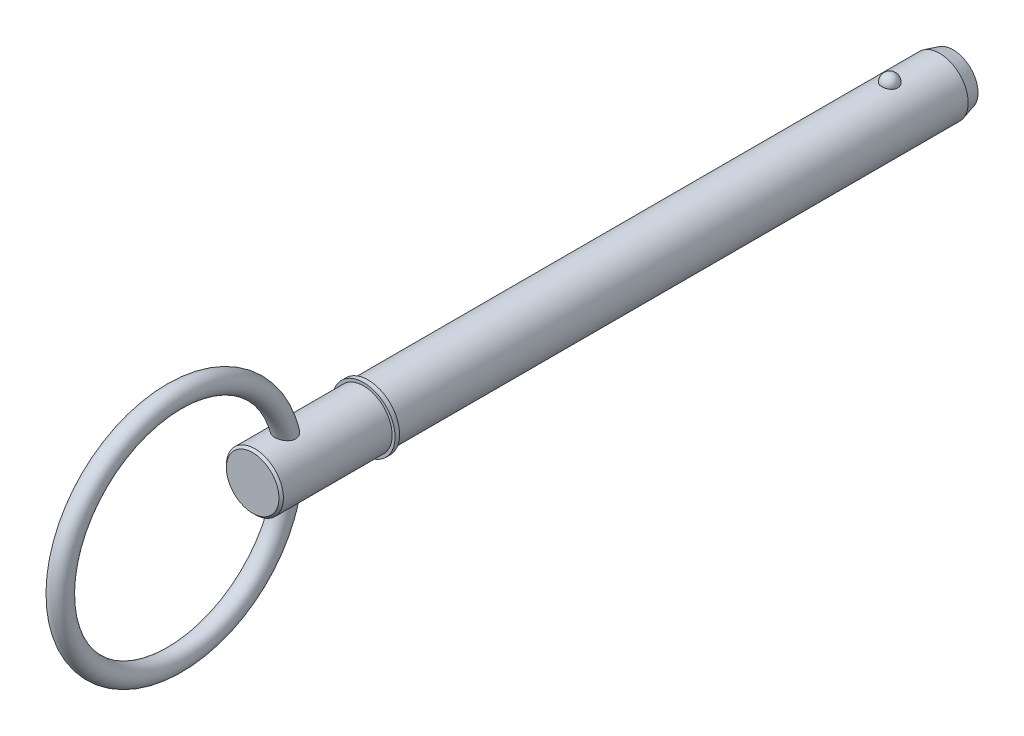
ISO-10303-21;
HEADER;
FILE_DESCRIPTION(('STEP AP214'),'2;1');
FILE_NAME('part.step','',(''),(''),'','','');
FILE_SCHEMA(('AUTOMOTIVE_DESIGN { 1 0 10303 214 1 1 1 1 }'));
ENDSEC;
DATA;
#1=APPLICATION_CONTEXT('core data for automotive mechanical design processes');
#2=APPLICATION_PROTOCOL_DEFINITION('international standard','automotive_design',2000,#1);
#3=PRODUCT_CONTEXT('',#1,'mechanical');
#4=PRODUCT('Part','Part','',(#3));
#5=PRODUCT_RELATED_PRODUCT_CATEGORY('part','',(#4));
#6=PRODUCT_DEFINITION_FORMATION('','',#4);
#7=PRODUCT_DEFINITION_CONTEXT('part definition',#1,'design');
#8=PRODUCT_DEFINITION('design','',#6,#7);
#9=PRODUCT_DEFINITION_SHAPE('','',#8);
#10=(LENGTH_UNIT() NAMED_UNIT(*) SI_UNIT(.MILLI.,.METRE.));
#11=(NAMED_UNIT(*) PLANE_ANGLE_UNIT() SI_UNIT($,.RADIAN.));
#12=(NAMED_UNIT(*) SI_UNIT($,.STERADIAN.) SOLID_ANGLE_UNIT());
#13=UNCERTAINTY_MEASURE_WITH_UNIT(LENGTH_MEASURE(1.E-05),#10,'distance_accuracy_value','');
#14=(GEOMETRIC_REPRESENTATION_CONTEXT(3) GLOBAL_UNCERTAINTY_ASSIGNED_CONTEXT((#13)) GLOBAL_UNIT_ASSIGNED_CONTEXT((#10,
#11,#12)) REPRESENTATION_CONTEXT('',''));
#15=CARTESIAN_POINT('',(0.,0.,0.));
#16=DIRECTION('',(0.,0.,1.));
#17=DIRECTION('',(1.,0.,0.));
#18=AXIS2_PLACEMENT_3D('',#15,#16,#17);
#19=CARTESIAN_POINT('',(0.,0.,114.3));
#20=DIRECTION('',(0.,0.,-1.));
#21=DIRECTION('',(-1.,0.,0.));
#22=AXIS2_PLACEMENT_3D('',#19,#20,#21);
#23=CYLINDRICAL_SURFACE('',#22,6.35);
#24=CARTESIAN_POINT('',(1.76243001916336,6.10051968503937,-1.78));
#25=CARTESIAN_POINT('',(1.76242835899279,6.10052111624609,-1.68050311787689));
#26=CARTESIAN_POINT('',(1.75431593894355,6.1028816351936,-1.58098521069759));
#27=CARTESIAN_POINT('',(1.72206027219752,6.11206037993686,-1.38476972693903));
#28=CARTESIAN_POINT('',(1.69791106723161,6.11888026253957,-1.28807321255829));
#29=CARTESIAN_POINT('',(1.63419596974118,6.13620287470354,-1.10029899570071));
#30=CARTESIAN_POINT('',(1.59463684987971,6.14670398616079,-1.00921884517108));
#31=CARTESIAN_POINT('',(1.50108569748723,6.17021534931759,-0.83516140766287));
#32=CARTESIAN_POINT('',(1.44709398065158,6.18322554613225,-0.752183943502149));
#33=CARTESIAN_POINT('',(1.3257243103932,6.21038081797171,-0.596209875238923));
#34=CARTESIAN_POINT('',(1.2582815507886,6.22453118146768,-0.523264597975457));
#35=CARTESIAN_POINT('',(1.11191624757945,6.25233390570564,-0.389855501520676));
#36=CARTESIAN_POINT('',(1.03299369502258,6.26598626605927,-0.329391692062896));
#37=CARTESIAN_POINT('',(0.866022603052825,6.29123226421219,-0.222793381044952));
#38=CARTESIAN_POINT('',(0.778000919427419,6.30283170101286,-0.176618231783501));
#39=CARTESIAN_POINT('',(0.59510847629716,6.32272058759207,-0.0996905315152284));
#40=CARTESIAN_POINT('',(0.500238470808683,6.33101040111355,-0.0689362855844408));
#41=CARTESIAN_POINT('',(0.308164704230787,6.34323464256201,-0.024159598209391));
#42=CARTESIAN_POINT('',(0.211033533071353,6.34724467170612,-0.00984637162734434));
#43=CARTESIAN_POINT('',(0.0156629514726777,6.3507318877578,0.00262058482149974));
#44=CARTESIAN_POINT('',(-0.0825763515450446,6.35020951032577,0.000775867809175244));
#45=CARTESIAN_POINT('',(-0.275890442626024,6.34473055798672,-0.0188727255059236));
#46=CARTESIAN_POINT('',(-0.370990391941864,6.3398374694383,-0.0364481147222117));
#47=CARTESIAN_POINT('',(-0.556805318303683,6.32622723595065,-0.0867447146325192));
#48=CARTESIAN_POINT('',(-0.647520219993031,6.31751002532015,-0.119466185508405));
#49=CARTESIAN_POINT('',(-0.822606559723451,6.29711353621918,-0.199386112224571));
#50=CARTESIAN_POINT('',(-0.906938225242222,6.28541739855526,-0.246667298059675));
#51=CARTESIAN_POINT('',(-1.06646479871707,6.26032612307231,-0.354365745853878));
#52=CARTESIAN_POINT('',(-1.14165877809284,6.24693081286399,-0.41478434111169));
#53=CARTESIAN_POINT('',(-1.2823514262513,6.21959142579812,-0.548435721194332));
#54=CARTESIAN_POINT('',(-1.34763761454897,6.2056417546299,-0.621891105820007));
#55=CARTESIAN_POINT('',(-1.4651153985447,6.17896241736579,-0.778815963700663));
#56=CARTESIAN_POINT('',(-1.51730606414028,6.16623283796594,-0.862286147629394));
#57=CARTESIAN_POINT('',(-1.60782211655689,6.14325839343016,-1.03799158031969));
#58=CARTESIAN_POINT('',(-1.64598111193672,6.13304379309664,-1.13031660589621));
#59=CARTESIAN_POINT('',(-1.70661885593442,6.11644899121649,-1.32030667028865));
#60=CARTESIAN_POINT('',(-1.72909805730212,6.11006867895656,-1.41797155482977));
#61=CARTESIAN_POINT('',(-1.75775019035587,6.1018881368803,-1.61543246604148));
#62=CARTESIAN_POINT('',(-1.76399136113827,6.10006874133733,-1.71521779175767));
#63=CARTESIAN_POINT('',(-1.76020715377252,6.10116172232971,-1.91445126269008));
#64=CARTESIAN_POINT('',(-1.75018221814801,6.10407397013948,-2.01389941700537));
#65=CARTESIAN_POINT('',(-1.71421005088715,6.11427232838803,-2.20912106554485));
#66=CARTESIAN_POINT('',(-1.68834262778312,6.12153651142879,-2.30491043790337));
#67=CARTESIAN_POINT('',(-1.62139543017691,6.1396067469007,-2.49066180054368));
#68=CARTESIAN_POINT('',(-1.5803150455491,6.15041294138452,-2.58062355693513));
#69=CARTESIAN_POINT('',(-1.48369112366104,6.17443456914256,-2.75271428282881));
#70=CARTESIAN_POINT('',(-1.42806998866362,6.18766281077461,-2.83479789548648));
#71=CARTESIAN_POINT('',(-1.30386620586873,6.21501934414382,-2.98832532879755));
#72=CARTESIAN_POINT('',(-1.23528306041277,6.22914767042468,-3.05976874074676));
#73=CARTESIAN_POINT('',(-1.08663999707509,6.25679135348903,-3.19029656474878));
#74=CARTESIAN_POINT('',(-1.00653826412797,6.27030422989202,-3.24933392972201));
#75=CARTESIAN_POINT('',(-0.837212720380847,6.29514770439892,-3.35304657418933));
#76=CARTESIAN_POINT('',(-0.747989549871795,6.30647845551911,-3.39772286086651));
#77=CARTESIAN_POINT('',(-0.564098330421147,6.32556124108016,-3.47096393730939));
#78=CARTESIAN_POINT('',(-0.469512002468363,6.33335611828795,-3.49972259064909));
#79=CARTESIAN_POINT('',(-0.27663389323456,6.34470628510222,-3.54113722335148));
#80=CARTESIAN_POINT('',(-0.17834256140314,6.34826208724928,-3.55379514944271));
#81=CARTESIAN_POINT('',(0.0171660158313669,6.35071525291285,-3.56255473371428));
#82=CARTESIAN_POINT('',(0.114368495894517,6.34969931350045,-3.55896450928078));
#83=CARTESIAN_POINT('',(0.306746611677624,6.34331695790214,-3.53603383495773));
#84=CARTESIAN_POINT('',(0.401922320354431,6.33795069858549,-3.51669395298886));
#85=CARTESIAN_POINT('',(0.587203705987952,6.32347219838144,-3.4629173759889));
#86=CARTESIAN_POINT('',(0.677327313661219,6.31437430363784,-3.42853846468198));
#87=CARTESIAN_POINT('',(0.850462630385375,6.29339543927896,-3.34564128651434));
#88=CARTESIAN_POINT('',(0.933473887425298,6.2815142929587,-3.29712212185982));
#89=CARTESIAN_POINT('',(1.09144542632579,6.25601750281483,-3.18638742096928));
#90=CARTESIAN_POINT('',(1.16626195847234,6.24237795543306,-3.12397237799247));
#91=CARTESIAN_POINT('',(1.304448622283,6.21497285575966,-2.98755865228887));
#92=CARTESIAN_POINT('',(1.36781676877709,6.20120728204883,-2.91355796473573));
#93=CARTESIAN_POINT('',(1.48252779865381,6.17479923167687,-2.75456133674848));
#94=CARTESIAN_POINT('',(1.53364167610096,6.16218052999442,-2.66939613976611));
#95=CARTESIAN_POINT('',(1.62109397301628,6.13975602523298,-2.49147502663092));
#96=CARTESIAN_POINT('',(1.657437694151,6.12994921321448,-2.39872184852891));
#97=CARTESIAN_POINT('',(1.71127844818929,6.11512175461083,-2.21887622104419));
#98=CARTESIAN_POINT('',(1.73042646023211,6.10968903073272,-2.13230770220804));
#99=CARTESIAN_POINT('',(1.75600284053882,6.10238739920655,-1.95716498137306));
#100=CARTESIAN_POINT('',(1.76243149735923,6.10051841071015,-1.86859082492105));
#101=CARTESIAN_POINT('',(1.76243001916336,6.10051968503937,-1.78));
#102=B_SPLINE_CURVE_WITH_KNOTS('',3,(#24,#25,#26,#27,#28,#29,#30,#31,#32,#33,#34,#35,#36,#37,
#38,#39,#40,#41,#42,#43,#44,#45,#46,#47,#48,#49,#50,#51,#52,#53,#54,#55,#56,#57,#58,#59,#60,#61,
#62,#63,#64,#65,#66,#67,#68,#69,#70,#71,#72,#73,#74,#75,#76,#77,#78,#79,#80,#81,#82,#83,#84,#85,
#86,#87,#88,#89,#90,#91,#92,#93,#94,#95,#96,#97,#98,#99,#100,#101),.UNSPECIFIED.,.T.,.F.,(4,2,2,
2,2,2,2,2,2,2,2,2,2,2,2,2,2,2,2,2,2,2,2,2,2,2,2,2,2,2,2,2,2,2,2,2,2,2,4),(0.,0.298172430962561,
0.596455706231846,0.894608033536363,1.19275383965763,1.49237238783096,1.79199116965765,
2.09074960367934,2.38947519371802,2.68283180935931,2.97616022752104,3.26529599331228,
3.5544367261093,3.84525169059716,4.13609618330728,4.43249276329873,4.72891038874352,
5.02873757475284,5.32855610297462,5.62711261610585,5.92566100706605,6.22271765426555,
6.519786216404,6.81847366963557,7.11717259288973,7.41698459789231,7.71677557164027,
8.01283014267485,8.30884891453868,8.59927798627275,8.88969658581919,9.17900899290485,
9.46833977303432,9.76212836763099,10.0559678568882,10.3549321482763,10.6537890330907,
10.9192841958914,11.1847733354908),.UNSPECIFIED.);
#103=CARTESIAN_POINT('',(1.76243001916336,6.10051968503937,-1.78));
#104=VERTEX_POINT('',#103);
#105=EDGE_CURVE('E101',#104,#104,#102,.T.);
#106=ORIENTED_EDGE('',*,*,#105,.T.);
#107=EDGE_LOOP('',(#106));
#108=FACE_BOUND('',#107,.T.);
#109=CARTESIAN_POINT('',(0.,0.,-12.88));
#110=DIRECTION('',(0.,0.,-1.));
#111=DIRECTION('',(-1.,0.,0.));
#112=AXIS2_PLACEMENT_3D('',#109,#110,#111);
#113=CIRCLE('',#112,6.35);
#114=CARTESIAN_POINT('',(-6.35,0.,-12.88));
#115=VERTEX_POINT('',#114);
#116=EDGE_CURVE('E109',#115,#115,#113,.F.);
#117=ORIENTED_EDGE('',*,*,#116,.T.);
#118=EDGE_LOOP('',(#117));
#119=FACE_BOUND('',#118,.T.);
#120=CARTESIAN_POINT('',(0.,0.,114.3));
#121=DIRECTION('',(0.,0.,1.));
#122=DIRECTION('',(1.,0.,0.));
#123=AXIS2_PLACEMENT_3D('',#120,#121,#122);
#124=CIRCLE('',#123,6.35);
#125=CARTESIAN_POINT('',(6.35,0.,114.3));
#126=VERTEX_POINT('',#125);
#127=EDGE_CURVE('E107',#126,#126,#124,.T.);
#128=ORIENTED_EDGE('',*,*,#127,.F.);
#129=EDGE_LOOP('',(#128));
#130=FACE_BOUND('',#129,.T.);
#131=ADVANCED_FACE('F39',(#108,#119,#130),#23,.T.);
#132=CARTESIAN_POINT('',(0.,0.,-15.88));
#133=DIRECTION('',(0.,0.,-1.));
#134=DIRECTION('',(-1.,0.,0.));
#135=AXIS2_PLACEMENT_3D('',#132,#133,#134);
#136=PLANE('',#135);
#137=CARTESIAN_POINT('',(0.,0.,-15.88));
#138=DIRECTION('',(0.,0.,-1.));
#139=DIRECTION('',(-1.,0.,0.));
#140=AXIS2_PLACEMENT_3D('',#137,#138,#139);
#141=CIRCLE('',#140,5.54615242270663);
#142=CARTESIAN_POINT('',(-5.54615242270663,0.,-15.88));
#143=VERTEX_POINT('',#142);
#144=EDGE_CURVE('E143',#143,#143,#141,.T.);
#145=ORIENTED_EDGE('',*,*,#144,.T.);
#146=EDGE_LOOP('',(#145));
#147=FACE_BOUND('',#146,.T.);
#148=ADVANCED_FACE('F87',(#147),#136,.T.);
#149=CARTESIAN_POINT('',(0.,0.,-15.88));
#150=DIRECTION('',(0.,0.,1.));
#151=DIRECTION('',(1.,0.,0.));
#152=AXIS2_PLACEMENT_3D('',#149,#150,#151);
#153=CONICAL_SURFACE('',#152,5.54615242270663,0.261799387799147);
#154=ORIENTED_EDGE('',*,*,#116,.F.);
#155=EDGE_LOOP('',(#154));
#156=FACE_BOUND('',#155,.T.);
#157=ORIENTED_EDGE('',*,*,#144,.F.);
#158=EDGE_LOOP('',(#157));
#159=FACE_BOUND('',#158,.T.);
#160=ADVANCED_FACE('F93',(#156,#159),#153,.T.);
#161=CARTESIAN_POINT('',(0.,6.35,-1.78));
#162=DIRECTION('',(0.,1.,0.));
#163=DIRECTION('',(0.,0.,1.));
#164=AXIS2_PLACEMENT_3D('',#161,#162,#163);
#165=SPHERICAL_SURFACE('',#164,1.78);
#166=ORIENTED_EDGE('',*,*,#105,.F.);
#167=EDGE_LOOP('',(#166));
#168=FACE_BOUND('',#167,.T.);
#169=ADVANCED_FACE('F112',(#168),#165,.T.);
#170=CARTESIAN_POINT('',(0.,0.,114.3));
#171=DIRECTION('',(0.,0.,-1.));
#172=DIRECTION('',(-1.,0.,0.));
#173=AXIS2_PLACEMENT_3D('',#170,#171,#172);
#174=PLANE('',#173);
#175=ORIENTED_EDGE('',*,*,#127,.T.);
#176=EDGE_LOOP('',(#175));
#177=FACE_BOUND('',#176,.T.);
#178=CARTESIAN_POINT('',(0.,0.,114.3));
#179=DIRECTION('',(0.,0.,-1.));
#180=DIRECTION('',(-1.,0.,0.));
#181=AXIS2_PLACEMENT_3D('',#178,#179,#180);
#182=CIRCLE('',#181,7.);
#183=CARTESIAN_POINT('',(-7.,0.,114.3));
#184=VERTEX_POINT('',#183);
#185=EDGE_CURVE('E108',#184,#184,#182,.T.);
#186=ORIENTED_EDGE('',*,*,#185,.T.);
#187=EDGE_LOOP('',(#186));
#188=FACE_BOUND('',#187,.T.);
#189=ADVANCED_FACE('F116',(#177,#188),#174,.T.);
#190=CARTESIAN_POINT('',(0.,0.,33.7287874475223));
#191=DIRECTION('',(0.,0.,-1.));
#192=DIRECTION('',(-1.,0.,0.));
#193=AXIS2_PLACEMENT_3D('',#190,#191,#192);
#194=CYLINDRICAL_SURFACE('',#193,7.);
#195=CARTESIAN_POINT('',(0.,0.,115.3));
#196=DIRECTION('',(0.,0.,-1.));
#197=DIRECTION('',(-1.,0.,0.));
#198=AXIS2_PLACEMENT_3D('',#195,#196,#197);
#199=CIRCLE('',#198,7.);
#200=CARTESIAN_POINT('',(-7.,0.,115.3));
#201=VERTEX_POINT('',#200);
#202=EDGE_CURVE('E133',#201,#201,#199,.T.);
#203=ORIENTED_EDGE('',*,*,#202,.T.);
#204=EDGE_LOOP('',(#203));
#205=FACE_BOUND('',#204,.T.);
#206=ORIENTED_EDGE('',*,*,#185,.F.);
#207=EDGE_LOOP('',(#206));
#208=FACE_BOUND('',#207,.T.);
#209=ADVANCED_FACE('F120',(#205,#208),#194,.T.);
#210=CARTESIAN_POINT('',(0.,7.,115.3));
#211=DIRECTION('',(0.,0.,1.));
#212=DIRECTION('',(1.,0.,0.));
#213=AXIS2_PLACEMENT_3D('',#210,#211,#212);
#214=PLANE('',#213);
#215=CARTESIAN_POINT('',(0.,0.,115.3));
#216=DIRECTION('',(0.,0.,1.));
#217=DIRECTION('',(1.,0.,0.));
#218=AXIS2_PLACEMENT_3D('',#215,#216,#217);
#219=CIRCLE('',#218,6.35);
#220=CARTESIAN_POINT('',(6.35,0.,115.3));
#221=VERTEX_POINT('',#220);
#222=EDGE_CURVE('E111',#221,#221,#219,.T.);
#223=ORIENTED_EDGE('',*,*,#222,.F.);
#224=EDGE_LOOP('',(#223));
#225=FACE_BOUND('',#224,.T.);
#226=ORIENTED_EDGE('',*,*,#202,.F.);
#227=EDGE_LOOP('',(#226));
#228=FACE_BOUND('',#227,.T.);
#229=ADVANCED_FACE('F84',(#225,#228),#214,.T.);
#230=CARTESIAN_POINT('',(0.,0.,140.));
#231=DIRECTION('',(0.,0.,-1.));
#232=DIRECTION('',(-1.,0.,0.));
#233=AXIS2_PLACEMENT_3D('',#230,#231,#232);
#234=CYLINDRICAL_SURFACE('',#233,6.35);
#235=CARTESIAN_POINT('',(-1.08120660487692,-6.25727514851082,130.75158117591));
#236=CARTESIAN_POINT('',(-0.970724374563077,-6.27636409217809,130.693879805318));
#237=CARTESIAN_POINT('',(-0.855136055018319,-6.29329984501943,130.645219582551));
#238=CARTESIAN_POINT('',(-0.616958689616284,-6.32109419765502,130.56705594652));
#239=CARTESIAN_POINT('',(-0.494369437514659,-6.3319526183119,130.53755309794));
#240=CARTESIAN_POINT('',(-0.245606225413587,-6.34647141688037,130.498367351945));
#241=CARTESIAN_POINT('',(-0.119431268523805,-6.35012977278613,130.488690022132));
#242=CARTESIAN_POINT('',(0.132849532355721,-6.34986313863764,130.489400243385));
#243=CARTESIAN_POINT('',(0.258955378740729,-6.34593843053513,130.499787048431));
#244=CARTESIAN_POINT('',(0.506912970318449,-6.33094785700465,130.540285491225));
#245=CARTESIAN_POINT('',(0.628781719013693,-6.31991516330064,130.570305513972));
#246=CARTESIAN_POINT('',(0.865486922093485,-6.29187143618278,130.649308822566));
#247=CARTESIAN_POINT('',(0.980322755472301,-6.27485987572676,130.698293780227));
#248=CARTESIAN_POINT('',(1.20050616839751,-6.23649440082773,130.814540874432));
#249=CARTESIAN_POINT('',(1.30578867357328,-6.2151135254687,130.881917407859));
#250=CARTESIAN_POINT('',(1.50311440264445,-6.17036440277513,131.033359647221));
#251=CARTESIAN_POINT('',(1.5951571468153,-6.14699608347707,131.117425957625));
#252=CARTESIAN_POINT('',(1.76326863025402,-6.10090072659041,131.300247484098));
#253=CARTESIAN_POINT('',(1.83935482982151,-6.07817301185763,131.398986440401));
#254=CARTESIAN_POINT('',(1.97338559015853,-6.03599268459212,131.608703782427));
#255=CARTESIAN_POINT('',(2.03133638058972,-6.01653894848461,131.719677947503));
#256=CARTESIAN_POINT('',(2.1259120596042,-5.98376466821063,131.947018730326));
#257=CARTESIAN_POINT('',(2.16315310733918,-5.97026970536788,132.063104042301));
#258=CARTESIAN_POINT('',(2.21830650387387,-5.94999923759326,132.300318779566));
#259=CARTESIAN_POINT('',(2.2362211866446,-5.94322292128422,132.421447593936));
#260=CARTESIAN_POINT('',(2.25273772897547,-5.93698111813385,132.663281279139));
#261=CARTESIAN_POINT('',(2.25163224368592,-5.93740484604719,132.783964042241));
#262=CARTESIAN_POINT('',(2.23167546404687,-5.94493297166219,133.023620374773));
#263=CARTESIAN_POINT('',(2.21281883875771,-5.9520393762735,133.142593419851));
#264=CARTESIAN_POINT('',(2.15679576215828,-5.97257680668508,133.383836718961));
#265=CARTESIAN_POINT('',(2.1185113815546,-5.98639144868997,133.50581287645));
#266=CARTESIAN_POINT('',(2.024702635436,-6.01876484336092,133.742284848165));
#267=CARTESIAN_POINT('',(1.96916879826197,-6.03732620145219,133.856776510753));
#268=CARTESIAN_POINT('',(1.83526629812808,-6.07945247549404,134.087995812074));
#269=CARTESIAN_POINT('',(1.75507038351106,-6.10334207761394,134.203611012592));
#270=CARTESIAN_POINT('',(1.5765788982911,-6.15186551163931,134.419894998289));
#271=CARTESIAN_POINT('',(1.47827192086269,-6.17649980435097,134.520554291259));
#272=CARTESIAN_POINT('',(1.26306696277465,-6.22410762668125,134.705023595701));
#273=CARTESIAN_POINT('',(1.14585214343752,-6.2470408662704,134.788478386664));
#274=CARTESIAN_POINT('',(0.896825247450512,-6.28760987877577,134.931400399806));
#275=CARTESIAN_POINT('',(0.765036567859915,-6.30525397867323,134.990905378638));
#276=CARTESIAN_POINT('',(0.509454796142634,-6.330648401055,135.075263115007));
#277=CARTESIAN_POINT('',(0.386964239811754,-6.33940909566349,135.103695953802));
#278=CARTESIAN_POINT('',(0.200813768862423,-6.3471308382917,135.128680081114));
#279=CARTESIAN_POINT('',(0.138353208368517,-6.34880140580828,135.134063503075));
#280=CARTESIAN_POINT('',(0.0131841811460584,-6.35029448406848,135.13887386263));
#281=CARTESIAN_POINT('',(-0.0495242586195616,-6.35011719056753,135.138301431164));
#282=CARTESIAN_POINT('',(-0.219860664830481,-6.34710452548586,135.128597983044));
#283=CARTESIAN_POINT('',(-0.327176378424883,-6.34243953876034,135.113576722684));
#284=CARTESIAN_POINT('',(-0.537619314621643,-6.32808248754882,135.066673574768));
#285=CARTESIAN_POINT('',(-0.640746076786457,-6.31838987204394,135.034789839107));
#286=CARTESIAN_POINT('',(-0.841795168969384,-6.29478075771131,134.955337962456));
#287=CARTESIAN_POINT('',(-0.939631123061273,-6.28081033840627,134.90756888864));
#288=CARTESIAN_POINT('',(-1.12690564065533,-6.2499288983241,134.798513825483));
#289=CARTESIAN_POINT('',(-1.21634109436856,-6.2330167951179,134.737222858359));
#290=CARTESIAN_POINT('',(-1.39713031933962,-6.19517308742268,134.594039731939));
#291=CARTESIAN_POINT('',(-1.48711596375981,-6.17400700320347,134.510483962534));
#292=CARTESIAN_POINT('',(-1.65373642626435,-6.13148145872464,134.330996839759));
#293=CARTESIAN_POINT('',(-1.73036130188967,-6.11012186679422,134.23505636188));
#294=CARTESIAN_POINT('',(-1.87908981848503,-6.0661652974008,134.018620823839));
#295=CARTESIAN_POINT('',(-1.94902044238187,-6.04382072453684,133.896572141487));
#296=CARTESIAN_POINT('',(-2.06849605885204,-6.00398244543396,133.642070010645));
#297=CARTESIAN_POINT('',(-2.11803457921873,-5.98649027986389,133.509613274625));
#298=CARTESIAN_POINT('',(-2.19551930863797,-5.95851933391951,133.234593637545));
#299=CARTESIAN_POINT('',(-2.22297667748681,-5.94819998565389,133.091874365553));
#300=CARTESIAN_POINT('',(-2.25222139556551,-5.93719450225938,132.803480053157));
#301=CARTESIAN_POINT('',(-2.25403508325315,-5.93649848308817,132.657808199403));
#302=CARTESIAN_POINT('',(-2.23178480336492,-5.94489150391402,132.383804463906));
#303=CARTESIAN_POINT('',(-2.21035650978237,-5.95298402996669,132.255226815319));
#304=CARTESIAN_POINT('',(-2.14565882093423,-5.97660650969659,132.00440891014));
#305=CARTESIAN_POINT('',(-2.10239634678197,-5.99213410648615,131.882166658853));
#306=CARTESIAN_POINT('',(-1.99913159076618,-6.02732890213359,131.656747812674));
#307=CARTESIAN_POINT('',(-1.94060271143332,-6.0466053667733,131.552829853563));
#308=CARTESIAN_POINT('',(-1.80736340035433,-6.0877569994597,131.356534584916));
#309=CARTESIAN_POINT('',(-1.73265259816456,-6.10963222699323,131.264157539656));
#310=CARTESIAN_POINT('',(-1.56865095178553,-6.15378470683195,131.092603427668));
#311=CARTESIAN_POINT('',(-1.47928749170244,-6.17606344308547,131.013496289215));
#312=CARTESIAN_POINT('',(-1.28858731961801,-6.21864788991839,130.870675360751));
#313=CARTESIAN_POINT('',(-1.18724893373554,-6.23895332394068,130.806963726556));
#314=CARTESIAN_POINT('',(-1.08120660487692,-6.25727514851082,130.75158117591));
#315=B_SPLINE_CURVE_WITH_KNOTS('',3,(#235,#236,#237,#238,#239,#240,#241,#242,#243,#244,#245,
#246,#247,#248,#249,#250,#251,#252,#253,#254,#255,#256,#257,#258,#259,#260,#261,#262,#263,#264,
#265,#266,#267,#268,#269,#270,#271,#272,#273,#274,#275,#276,#277,#278,#279,#280,#281,#282,#283,
#284,#285,#286,#287,#288,#289,#290,#291,#292,#293,#294,#295,#296,#297,#298,#299,#300,#301,#302,
#303,#304,#305,#306,#307,#308,#309,#310,#311,#312,#313,#314),.UNSPECIFIED.,.T.,.F.,(4,2,2,2,2,2,
2,2,2,2,2,2,2,2,2,2,2,2,2,2,2,2,2,2,2,2,2,2,2,2,2,2,2,2,2,2,2,2,2,4),(0.,0.377861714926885,
0.755734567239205,1.13371352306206,1.51167842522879,1.88789208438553,2.26413891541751,
2.64278156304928,3.02143792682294,3.3996777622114,3.77778752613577,4.14394628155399,
4.51006081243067,4.87054720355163,5.23114188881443,5.61534494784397,5.99975934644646,
6.42600522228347,6.8525204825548,7.28711365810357,7.72101899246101,8.09666132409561,
8.28452949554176,8.47237776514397,8.7960795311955,9.11981678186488,9.44781545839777,
9.77593508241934,10.1483085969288,10.5209580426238,10.9463240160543,11.3718248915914,
11.8065046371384,12.240737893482,12.6304236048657,13.0199858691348,13.3807583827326,
13.7415391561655,14.104165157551,14.4668419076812),.UNSPECIFIED.);
#316=CARTESIAN_POINT('',(-1.08120660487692,-6.25727514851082,130.75158117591));
#317=VERTEX_POINT('',#316);
#318=EDGE_CURVE('E10',#317,#317,#315,.T.);
#319=ORIENTED_EDGE('',*,*,#318,.F.);
#320=EDGE_LOOP('',(#319));
#321=FACE_BOUND('',#320,.T.);
#322=CARTESIAN_POINT('',(-1.08120660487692,6.25727514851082,130.75158117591));
#323=CARTESIAN_POINT('',(-1.19093168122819,6.23831652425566,130.808887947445));
#324=CARTESIAN_POINT('',(-1.29562751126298,6.21723224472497,130.875116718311));
#325=CARTESIAN_POINT('',(-1.49211272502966,6.17302620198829,131.024020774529));
#326=CARTESIAN_POINT('',(-1.58390200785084,6.14990442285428,131.106696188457));
#327=CARTESIAN_POINT('',(-1.75209695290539,6.10411985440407,131.286777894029));
#328=CARTESIAN_POINT('',(-1.82848346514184,6.08145766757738,131.384202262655));
#329=CARTESIAN_POINT('',(-1.96346259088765,6.03923311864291,131.591273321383));
#330=CARTESIAN_POINT('',(-2.02206050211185,6.01966983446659,131.700916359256));
#331=CARTESIAN_POINT('',(-2.11860444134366,5.9863659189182,131.926564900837));
#332=CARTESIAN_POINT('',(-2.15701637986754,5.97249571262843,132.042351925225));
#333=CARTESIAN_POINT('',(-2.21449304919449,5.95142584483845,132.279191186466));
#334=CARTESIAN_POINT('',(-2.23356015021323,5.94422536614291,132.400242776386));
#335=CARTESIAN_POINT('',(-2.25228141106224,5.93715610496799,132.641944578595));
#336=CARTESIAN_POINT('',(-2.25225786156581,5.93716560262,132.762567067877));
#337=CARTESIAN_POINT('',(-2.2344206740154,5.94389982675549,133.002277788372));
#338=CARTESIAN_POINT('',(-2.21660184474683,5.95062651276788,133.121365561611));
#339=CARTESIAN_POINT('',(-2.16272689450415,5.97042554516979,133.362705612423));
#340=CARTESIAN_POINT('',(-2.12559286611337,5.98387086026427,133.484684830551));
#341=CARTESIAN_POINT('',(-2.03409944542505,6.01558578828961,133.721342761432));
#342=CARTESIAN_POINT('',(-1.97973080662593,6.03385799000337,133.836017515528));
#343=CARTESIAN_POINT('',(-1.84828023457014,6.07549301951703,134.067865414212));
#344=CARTESIAN_POINT('',(-1.76936622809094,6.09919386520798,134.183943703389));
#345=CARTESIAN_POINT('',(-1.59344783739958,6.14749881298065,134.401420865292));
#346=CARTESIAN_POINT('',(-1.49643151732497,6.17210350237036,134.502809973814));
#347=CARTESIAN_POINT('',(-1.28333318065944,6.21994692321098,134.689508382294));
#348=CARTESIAN_POINT('',(-1.1668572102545,6.24314005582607,134.7743845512));
#349=CARTESIAN_POINT('',(-0.919062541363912,6.2843871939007,134.92034404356));
#350=CARTESIAN_POINT('',(-0.78776676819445,6.30244898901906,134.981463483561));
#351=CARTESIAN_POINT('',(-0.532335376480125,6.32876911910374,135.06911129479));
#352=CARTESIAN_POINT('',(-0.409516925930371,6.33800211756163,135.099123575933));
#353=CARTESIAN_POINT('',(-0.222636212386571,6.34640533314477,135.126338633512));
#354=CARTESIAN_POINT('',(-0.159893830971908,6.34829860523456,135.132442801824));
#355=CARTESIAN_POINT('',(-0.0340877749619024,6.35021985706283,135.13863417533));
#356=CARTESIAN_POINT('',(0.0289758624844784,6.35024804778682,135.13872206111));
#357=CARTESIAN_POINT('',(0.200008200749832,6.34776620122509,135.130732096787));
#358=CARTESIAN_POINT('',(0.307730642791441,6.34342046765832,135.11675007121));
#359=CARTESIAN_POINT('',(0.51913450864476,6.32963338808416,135.071765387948));
#360=CARTESIAN_POINT('',(0.622815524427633,6.3201915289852,135.040761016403));
#361=CARTESIAN_POINT('',(0.824580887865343,6.2970603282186,134.963086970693));
#362=CARTESIAN_POINT('',(0.922611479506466,6.28333629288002,134.916289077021));
#363=CARTESIAN_POINT('',(1.11039970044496,6.2528858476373,134.809122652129));
#364=CARTESIAN_POINT('',(1.20015435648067,6.23615836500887,134.748749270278));
#365=CARTESIAN_POINT('',(1.38155818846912,6.19866747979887,134.60760245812));
#366=CARTESIAN_POINT('',(1.47187645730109,6.17766310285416,134.525184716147));
#367=CARTESIAN_POINT('',(1.63933626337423,6.13535258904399,134.347946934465));
#368=CARTESIAN_POINT('',(1.71646809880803,6.11404624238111,134.253117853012));
#369=CARTESIAN_POINT('',(1.86660460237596,6.07002946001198,134.038851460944));
#370=CARTESIAN_POINT('',(1.93743710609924,6.04755477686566,133.917834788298));
#371=CARTESIAN_POINT('',(2.05894300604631,6.00727604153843,133.665280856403));
#372=CARTESIAN_POINT('',(2.10960917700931,5.98947366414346,133.533739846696));
#373=CARTESIAN_POINT('',(2.18982014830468,5.96062717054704,133.259758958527));
#374=CARTESIAN_POINT('',(2.21877575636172,5.94977267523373,133.117123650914));
#375=CARTESIAN_POINT('',(2.25104759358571,5.93764416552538,132.828595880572));
#376=CARTESIAN_POINT('',(2.25438985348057,5.93636042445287,132.682706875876));
#377=CARTESIAN_POINT('',(2.23498011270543,5.94368858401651,132.407731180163));
#378=CARTESIAN_POINT('',(2.21482640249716,5.95131530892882,132.278434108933));
#379=CARTESIAN_POINT('',(2.15248760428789,5.97414352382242,132.025969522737));
#380=CARTESIAN_POINT('',(2.11031020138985,5.98934237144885,131.902799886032));
#381=CARTESIAN_POINT('',(2.00904610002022,6.02402214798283,131.675783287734));
#382=CARTESIAN_POINT('',(1.95150192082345,6.04308594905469,131.571178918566));
#383=CARTESIAN_POINT('',(1.82009972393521,6.08395083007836,131.373382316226));
#384=CARTESIAN_POINT('',(1.74624088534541,6.10575204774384,131.280190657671));
#385=CARTESIAN_POINT('',(1.58309476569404,6.15008431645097,131.106164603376));
#386=CARTESIAN_POINT('',(1.49360904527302,6.17262128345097,131.025518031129));
#387=CARTESIAN_POINT('',(1.30231515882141,6.21579297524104,130.879836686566));
#388=CARTESIAN_POINT('',(1.20050521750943,6.23642742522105,130.81480416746));
#389=CARTESIAN_POINT('',(0.983786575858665,6.27432316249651,130.6998596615));
#390=CARTESIAN_POINT('',(0.868563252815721,6.29145558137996,130.650497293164));
#391=CARTESIAN_POINT('',(0.630994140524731,6.31970327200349,130.570885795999));
#392=CARTESIAN_POINT('',(0.508648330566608,6.33081852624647,130.540636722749));
#393=CARTESIAN_POINT('',(0.259933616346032,6.34590352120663,130.499879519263));
#394=CARTESIAN_POINT('',(0.133554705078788,6.34985380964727,130.489425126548));
#395=CARTESIAN_POINT('',(-0.119270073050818,6.35013815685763,130.488667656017));
#396=CARTESIAN_POINT('',(-0.245715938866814,6.34647233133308,130.498364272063));
#397=CARTESIAN_POINT('',(-0.494670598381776,6.33192772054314,130.537620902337));
#398=CARTESIAN_POINT('',(-0.617189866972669,6.3210701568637,130.567122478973));
#399=CARTESIAN_POINT('',(-0.855240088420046,6.29328476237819,130.645263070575));
#400=CARTESIAN_POINT('',(-0.970770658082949,6.27635659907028,130.693903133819));
#401=CARTESIAN_POINT('',(-1.08120660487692,6.25727514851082,130.75158117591));
#402=B_SPLINE_CURVE_WITH_KNOTS('',3,(#322,#323,#324,#325,#326,#327,#328,#329,#330,#331,#332,
#333,#334,#335,#336,#337,#338,#339,#340,#341,#342,#343,#344,#345,#346,#347,#348,#349,#350,#351,
#352,#353,#354,#355,#356,#357,#358,#359,#360,#361,#362,#363,#364,#365,#366,#367,#368,#369,#370,
#371,#372,#373,#374,#375,#376,#377,#378,#379,#380,#381,#382,#383,#384,#385,#386,#387,#388,#389,
#390,#391,#392,#393,#394,#395,#396,#397,#398,#399,#400,#401),.UNSPECIFIED.,.T.,.F.,(4,2,2,2,2,2,
2,2,2,2,2,2,2,2,2,2,2,2,2,2,2,2,2,2,2,2,2,2,2,2,2,2,2,2,2,2,2,2,2,4),(0.,0.375258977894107,
0.750520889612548,1.12624651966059,1.50186014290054,1.86837438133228,2.23484370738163,
2.59512638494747,2.95551419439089,3.33859924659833,3.7218901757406,4.14704029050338,
4.57247172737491,5.00788576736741,5.44263524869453,5.82040093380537,6.00932292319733,
6.19822354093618,6.52266071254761,6.8471305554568,7.17430063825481,7.50158780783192,
7.87233275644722,8.24334931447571,8.66748794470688,9.09177840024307,9.52720369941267,
9.96218641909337,10.3532895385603,10.7442562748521,11.1052784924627,11.4663188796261,
11.8323306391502,12.1983951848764,12.5761580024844,12.9539219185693,13.3327099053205,
13.7114921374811,14.0891615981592,14.4668517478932),.UNSPECIFIED.);
#403=CARTESIAN_POINT('',(-1.08120660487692,6.25727514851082,130.75158117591));
#404=VERTEX_POINT('',#403);
#405=EDGE_CURVE('E51',#404,#404,#402,.T.);
#406=ORIENTED_EDGE('',*,*,#405,.F.);
#407=EDGE_LOOP('',(#406));
#408=FACE_BOUND('',#407,.T.);
#409=CARTESIAN_POINT('',(0.,0.,139.5));
#410=DIRECTION('',(0.,0.,-1.));
#411=DIRECTION('',(-1.,0.,0.));
#412=AXIS2_PLACEMENT_3D('',#409,#410,#411);
#413=CIRCLE('',#412,6.35);
#414=CARTESIAN_POINT('',(-6.35,0.,139.5));
#415=VERTEX_POINT('',#414);
#416=EDGE_CURVE('E63',#415,#415,#413,.T.);
#417=ORIENTED_EDGE('',*,*,#416,.T.);
#418=EDGE_LOOP('',(#417));
#419=FACE_BOUND('',#418,.T.);
#420=ORIENTED_EDGE('',*,*,#222,.T.);
#421=EDGE_LOOP('',(#420));
#422=FACE_BOUND('',#421,.T.);
#423=ADVANCED_FACE('F68',(#321,#408,#419,#422),#234,.T.);
#424=CARTESIAN_POINT('',(0.,0.,140.));
#425=DIRECTION('',(0.,0.,-1.));
#426=DIRECTION('',(-1.,0.,0.));
#427=AXIS2_PLACEMENT_3D('',#424,#425,#426);
#428=PLANE('',#427);
#429=CARTESIAN_POINT('',(0.,0.,140.));
#430=DIRECTION('',(0.,0.,-1.));
#431=DIRECTION('',(-1.,0.,0.));
#432=AXIS2_PLACEMENT_3D('',#429,#430,#431);
#433=CIRCLE('',#432,5.84999999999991);
#434=CARTESIAN_POINT('',(-5.84999999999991,0.,140.));
#435=VERTEX_POINT('',#434);
#436=EDGE_CURVE('E58',#435,#435,#433,.F.);
#437=ORIENTED_EDGE('',*,*,#436,.T.);
#438=EDGE_LOOP('',(#437));
#439=FACE_BOUND('',#438,.T.);
#440=ADVANCED_FACE('F75',(#439),#428,.F.);
#441=CARTESIAN_POINT('',(0.,0.,139.5));
#442=DIRECTION('',(0.,0.,-1.));
#443=DIRECTION('',(-1.,0.,0.));
#444=AXIS2_PLACEMENT_3D('',#441,#442,#443);
#445=CONICAL_SURFACE('',#444,6.35,0.785398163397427);
#446=ORIENTED_EDGE('',*,*,#436,.F.);
#447=EDGE_LOOP('',(#446));
#448=FACE_BOUND('',#447,.T.);
#449=ORIENTED_EDGE('',*,*,#416,.F.);
#450=EDGE_LOOP('',(#449));
#451=FACE_BOUND('',#450,.T.);
#452=ADVANCED_FACE('F41',(#448,#451),#445,.T.);
#453=CARTESIAN_POINT('',(0.,0.,157.4));
#454=DIRECTION('',(1.,0.,0.));
#455=DIRECTION('',(0.,0.,-1.));
#456=AXIS2_PLACEMENT_3D('',#453,#454,#455);
#457=TOROIDAL_SURFACE('',#456,25.4,2.25);
#458=ORIENTED_EDGE('',*,*,#318,.T.);
#459=EDGE_LOOP('',(#458));
#460=FACE_BOUND('',#459,.T.);
#461=ORIENTED_EDGE('',*,*,#405,.T.);
#462=EDGE_LOOP('',(#461));
#463=FACE_BOUND('',#462,.T.);
#464=ADVANCED_FACE('F72',(#460,#463),#457,.T.);
#465=CLOSED_SHELL('',(#131,#148,#160,#169,#189,#209,#229,#423,#440,#452,#464));
#466=MANIFOLD_SOLID_BREP('B2',#465);
#467=ADVANCED_BREP_SHAPE_REPRESENTATION('',(#18,#466),#14);
#468=SHAPE_DEFINITION_REPRESENTATION(#9,#467);
ENDSEC;
END-ISO-10303-21;
